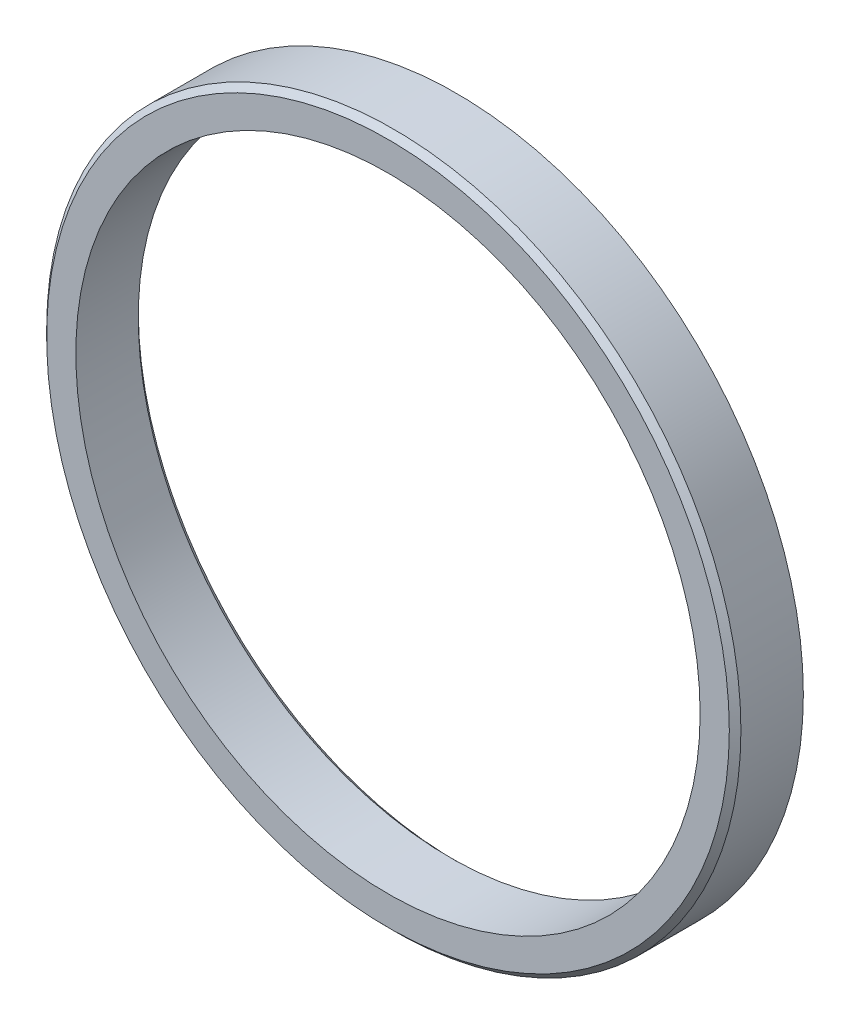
ISO-10303-21;
HEADER;
FILE_DESCRIPTION(('STEP AP214'),'2;1');
FILE_NAME('part.step','',(''),(''),'','','');
FILE_SCHEMA(('AUTOMOTIVE_DESIGN { 1 0 10303 214 1 1 1 1 }'));
ENDSEC;
DATA;
#1=APPLICATION_CONTEXT('core data for automotive mechanical design processes');
#2=APPLICATION_PROTOCOL_DEFINITION('international standard','automotive_design',2000,#1);
#3=PRODUCT_CONTEXT('',#1,'mechanical');
#4=PRODUCT('Part','Part','',(#3));
#5=PRODUCT_RELATED_PRODUCT_CATEGORY('part','',(#4));
#6=PRODUCT_DEFINITION_FORMATION('','',#4);
#7=PRODUCT_DEFINITION_CONTEXT('part definition',#1,'design');
#8=PRODUCT_DEFINITION('design','',#6,#7);
#9=PRODUCT_DEFINITION_SHAPE('','',#8);
#10=(LENGTH_UNIT() NAMED_UNIT(*) SI_UNIT(.MILLI.,.METRE.));
#11=(NAMED_UNIT(*) PLANE_ANGLE_UNIT() SI_UNIT($,.RADIAN.));
#12=(NAMED_UNIT(*) SI_UNIT($,.STERADIAN.) SOLID_ANGLE_UNIT());
#13=UNCERTAINTY_MEASURE_WITH_UNIT(LENGTH_MEASURE(1.E-05),#10,'distance_accuracy_value','');
#14=(GEOMETRIC_REPRESENTATION_CONTEXT(3) GLOBAL_UNCERTAINTY_ASSIGNED_CONTEXT((#13)) GLOBAL_UNIT_ASSIGNED_CONTEXT((#10,
#11,#12)) REPRESENTATION_CONTEXT('',''));
#15=CARTESIAN_POINT('',(0.,0.,0.));
#16=DIRECTION('',(0.,0.,1.));
#17=DIRECTION('',(1.,0.,0.));
#18=AXIS2_PLACEMENT_3D('',#15,#16,#17);
#19=CARTESIAN_POINT('',(0.,117.55,10.75));
#20=DIRECTION('',(0.,0.,-1.));
#21=DIRECTION('',(-1.,0.,0.));
#22=AXIS2_PLACEMENT_3D('',#19,#20,#21);
#23=PLANE('',#22);
#24=CARTESIAN_POINT('',(0.,0.,10.75));
#25=DIRECTION('',(0.,0.,1.));
#26=DIRECTION('',(1.,0.,0.));
#27=AXIS2_PLACEMENT_3D('',#24,#25,#26);
#28=CIRCLE('',#27,107.5);
#29=CARTESIAN_POINT('',(107.5,0.,10.75));
#30=VERTEX_POINT('',#29);
#31=EDGE_CURVE('E10',#30,#30,#28,.T.);
#32=ORIENTED_EDGE('',*,*,#31,.F.);
#33=EDGE_LOOP('',(#32));
#34=FACE_BOUND('',#33,.T.);
#35=CARTESIAN_POINT('',(0.,0.,10.75));
#36=DIRECTION('',(0.,0.,1.));
#37=DIRECTION('',(1.,0.,0.));
#38=AXIS2_PLACEMENT_3D('',#35,#36,#37);
#39=CIRCLE('',#38,117.55);
#40=CARTESIAN_POINT('',(117.55,0.,10.75));
#41=VERTEX_POINT('',#40);
#42=EDGE_CURVE('E53',#41,#41,#39,.T.);
#43=ORIENTED_EDGE('',*,*,#42,.T.);
#44=EDGE_LOOP('',(#43));
#45=FACE_BOUND('',#44,.T.);
#46=ADVANCED_FACE('F31',(#34,#45),#23,.F.);
#47=CARTESIAN_POINT('',(0.,0.,66.6227492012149));
#48=DIRECTION('',(0.,0.,1.));
#49=DIRECTION('',(1.,0.,0.));
#50=AXIS2_PLACEMENT_3D('',#47,#48,#49);
#51=CYLINDRICAL_SURFACE('',#50,107.5);
#52=CARTESIAN_POINT('',(0.,0.,-10.75));
#53=DIRECTION('',(0.,0.,1.));
#54=DIRECTION('',(1.,0.,0.));
#55=AXIS2_PLACEMENT_3D('',#52,#53,#54);
#56=CIRCLE('',#55,107.5);
#57=CARTESIAN_POINT('',(107.5,0.,-10.75));
#58=VERTEX_POINT('',#57);
#59=EDGE_CURVE('E37',#58,#58,#56,.T.);
#60=ORIENTED_EDGE('',*,*,#59,.F.);
#61=EDGE_LOOP('',(#60));
#62=FACE_BOUND('',#61,.T.);
#63=ORIENTED_EDGE('',*,*,#31,.T.);
#64=EDGE_LOOP('',(#63));
#65=FACE_BOUND('',#64,.T.);
#66=ADVANCED_FACE('F78',(#62,#65),#51,.F.);
#67=CARTESIAN_POINT('',(0.,0.,-10.75));
#68=DIRECTION('',(0.,0.,-1.));
#69=DIRECTION('',(-1.,0.,0.));
#70=AXIS2_PLACEMENT_3D('',#67,#68,#69);
#71=CONICAL_SURFACE('',#70,107.5,0.785398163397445);
#72=CARTESIAN_POINT('',(0.,0.,-12.75));
#73=DIRECTION('',(0.,0.,1.));
#74=DIRECTION('',(1.,0.,0.));
#75=AXIS2_PLACEMENT_3D('',#72,#73,#74);
#76=CIRCLE('',#75,109.5);
#77=CARTESIAN_POINT('',(109.5,0.,-12.75));
#78=VERTEX_POINT('',#77);
#79=EDGE_CURVE('E41',#78,#78,#76,.T.);
#80=ORIENTED_EDGE('',*,*,#79,.F.);
#81=EDGE_LOOP('',(#80));
#82=FACE_BOUND('',#81,.T.);
#83=ORIENTED_EDGE('',*,*,#59,.T.);
#84=EDGE_LOOP('',(#83));
#85=FACE_BOUND('',#84,.T.);
#86=ADVANCED_FACE('F73',(#82,#85),#71,.F.);
#87=CARTESIAN_POINT('',(0.,109.5,-12.75));
#88=DIRECTION('',(0.,0.,1.));
#89=DIRECTION('',(1.,0.,0.));
#90=AXIS2_PLACEMENT_3D('',#87,#88,#89);
#91=PLANE('',#90);
#92=CARTESIAN_POINT('',(0.,0.,-12.75));
#93=DIRECTION('',(0.,0.,1.));
#94=DIRECTION('',(1.,0.,0.));
#95=AXIS2_PLACEMENT_3D('',#92,#93,#94);
#96=CIRCLE('',#95,119.55);
#97=CARTESIAN_POINT('',(119.55,0.,-12.75));
#98=VERTEX_POINT('',#97);
#99=EDGE_CURVE('E45',#98,#98,#96,.T.);
#100=ORIENTED_EDGE('',*,*,#99,.F.);
#101=EDGE_LOOP('',(#100));
#102=FACE_BOUND('',#101,.T.);
#103=ORIENTED_EDGE('',*,*,#79,.T.);
#104=EDGE_LOOP('',(#103));
#105=FACE_BOUND('',#104,.T.);
#106=ADVANCED_FACE('F67',(#102,#105),#91,.F.);
#107=CARTESIAN_POINT('',(0.,0.,66.6227492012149));
#108=DIRECTION('',(0.,0.,1.));
#109=DIRECTION('',(1.,0.,0.));
#110=AXIS2_PLACEMENT_3D('',#107,#108,#109);
#111=CYLINDRICAL_SURFACE('',#110,119.55);
#112=CARTESIAN_POINT('',(0.,0.,8.75000000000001));
#113=DIRECTION('',(0.,0.,1.));
#114=DIRECTION('',(1.,0.,0.));
#115=AXIS2_PLACEMENT_3D('',#112,#113,#114);
#116=CIRCLE('',#115,119.55);
#117=CARTESIAN_POINT('',(119.55,0.,8.75000000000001));
#118=VERTEX_POINT('',#117);
#119=EDGE_CURVE('E50',#118,#118,#116,.T.);
#120=ORIENTED_EDGE('',*,*,#119,.F.);
#121=EDGE_LOOP('',(#120));
#122=FACE_BOUND('',#121,.T.);
#123=ORIENTED_EDGE('',*,*,#99,.T.);
#124=EDGE_LOOP('',(#123));
#125=FACE_BOUND('',#124,.T.);
#126=ADVANCED_FACE('F61',(#122,#125),#111,.T.);
#127=CARTESIAN_POINT('',(0.,0.,8.75000000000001));
#128=DIRECTION('',(0.,0.,-1.));
#129=DIRECTION('',(-1.,0.,0.));
#130=AXIS2_PLACEMENT_3D('',#127,#128,#129);
#131=CONICAL_SURFACE('',#130,119.55,0.785398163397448);
#132=ORIENTED_EDGE('',*,*,#42,.F.);
#133=EDGE_LOOP('',(#132));
#134=FACE_BOUND('',#133,.T.);
#135=ORIENTED_EDGE('',*,*,#119,.T.);
#136=EDGE_LOOP('',(#135));
#137=FACE_BOUND('',#136,.T.);
#138=ADVANCED_FACE('F58',(#134,#137),#131,.T.);
#139=CLOSED_SHELL('',(#46,#66,#86,#106,#126,#138));
#140=MANIFOLD_SOLID_BREP('B2',#139);
#141=ADVANCED_BREP_SHAPE_REPRESENTATION('',(#18,#140),#14);
#142=SHAPE_DEFINITION_REPRESENTATION(#9,#141);
ENDSEC;
END-ISO-10303-21;
